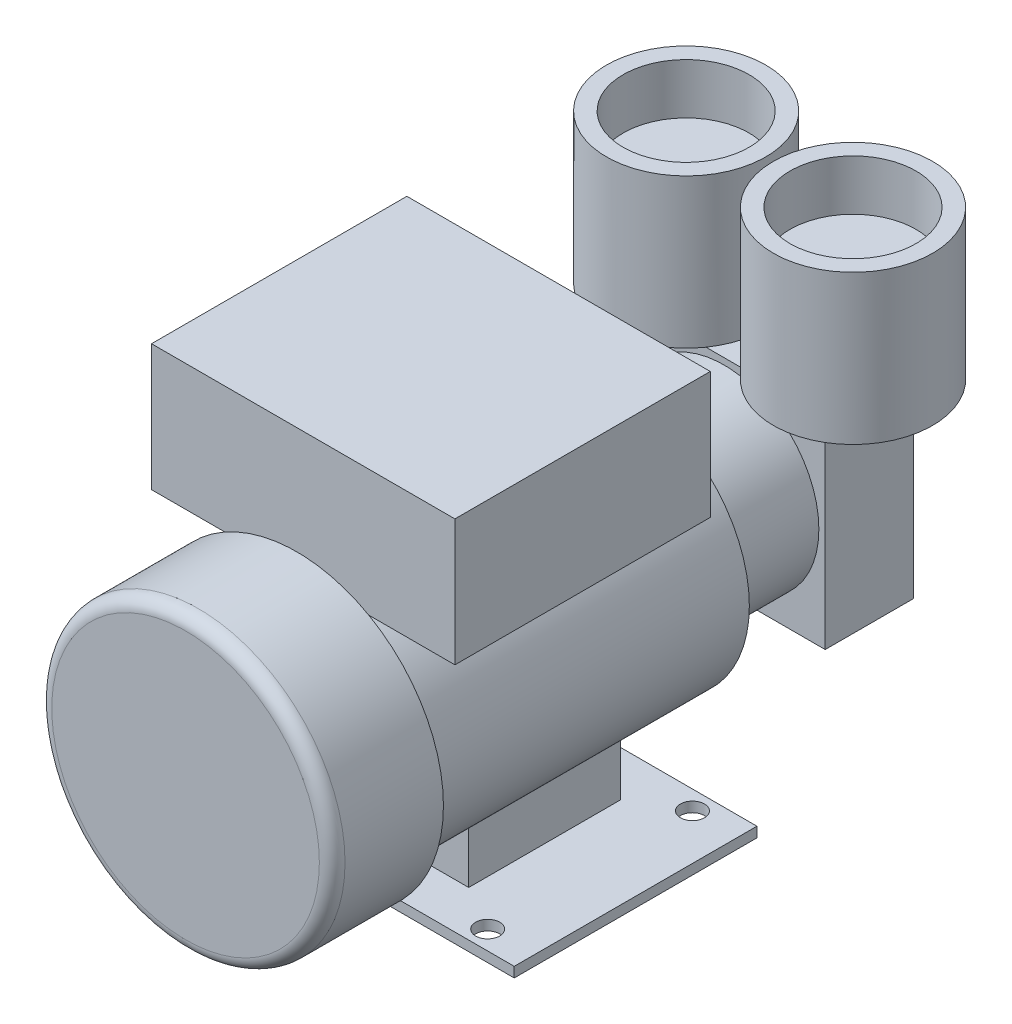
from build123d import *

# Parameters (mm, degrees)
SKETCH1_R              = 50
BOSS_EXTRUDE1_DEPTH    = 129
SKETCH2_W              = 132
SKETCH2_H              = 96
SKETCH2_R              = 4.75
BASE_PLATE_DEPTH       = 4
SKETCH3_R              = 37.5
MOTOR_PUMP_PLATE_DEPTH = 40
SKETCH18_W             = 101
SKETCH18_H             = 120
ELECTRICAL_BOX_DEPTH   = 50
SKETCH19_R             = 58
FAN_SHROUD_DEPTH       = 44
FILLET1_R              = 5.08
SKETCH20_W             = 80
SKETCH20_H             = 80
PUMP_HEAD_DEPTH        = 35
SKETCH21_W             = 60
SKETCH21_H             = 60
BOSS_EXTRUDE14_DEPTH   = 25
SKETCH23_R             = 31.5
BOSS_EXTRUDE15_DEPTH   = 59
SKETCH24_R             = 24.914163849
CUT_EXTRUDE1_DEPTH     = 20


with BuildPart() as part:
    # Sketch1 → Boss-Extrude1 (new body)
    with BuildSketch(Plane.XY):
        Circle(SKETCH1_R)
    extrude(amount=-BOSS_EXTRUDE1_DEPTH)

    # Sketch3 → Motor-pump-plate (add)
    with BuildSketch(Plane(origin=(0, 0, -129), x_dir=(-1, 0, 0), z_dir=(0, 0, -1))):
        with Locations(Location((0, 0, 0), (0, 0, 180))):
            Circle(SKETCH3_R)
    extrude(amount=MOTOR_PUMP_PLATE_DEPTH)

    # Sketch18 → Electrical_box (add)
    with BuildSketch(Plane(origin=(0, 48.000000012, 0), x_dir=(0, 0, -1), z_dir=(0, 1, 0))):
        with Locations((53.04, 0)):
            Rectangle(SKETCH18_W, SKETCH18_H)
    extrude(amount=ELECTRICAL_BOX_DEPTH)

    # Sketch19 → Fan_shroud (add)
    with BuildSketch(Plane.XY):
        Circle(SKETCH19_R)
    extrude(amount=FAN_SHROUD_DEPTH)

    # Fillet1
    fillet1_edges = [part.edges().sort_by_distance(p)[0] for p in [
        (-58, 0, 44),
    ]]
    fillet(fillet1_edges, radius=FILLET1_R)

    # Sketch20 → Pump_head (add)
    with BuildSketch(Plane(origin=(0, 0, -169), x_dir=(-1, 0, 0), z_dir=(0, 0, -1))):
        Rectangle(SKETCH20_W, SKETCH20_H)
    extrude(amount=PUMP_HEAD_DEPTH)



with BuildPart() as body_2:
    # Sketch2 → Base_plate (new body)
    with BuildSketch(Plane(origin=(0, -65, 0), x_dir=(-1, 0, 0), z_dir=(0, 1, 0))):
        with Locations((0, -68)):
            Rectangle(SKETCH2_W, SKETCH2_H)
        with Locations(Location((-48, -108.5, 0), (0, 0, 90))):
            Circle(SKETCH2_R, mode=Mode.SUBTRACT)
        with Locations(Location((48, -108.5, 0), (0, 0, 90))):
            Circle(SKETCH2_R, mode=Mode.SUBTRACT)
        with Locations(Location((-48, -27.5, 0), (0, 0, 90))):
            Circle(SKETCH2_R, mode=Mode.SUBTRACT)
        with Locations(Location((48, -27.5, 0), (0, 0, 90))):
            Circle(SKETCH2_R, mode=Mode.SUBTRACT)
    extrude(amount=BASE_PLATE_DEPTH)


with BuildPart() as part_1:
    add(part.part)

    add(body_2.part)  # Boss-Extrude14 merges body 2
    # Sketch21 → Boss-Extrude14 (add)
    with BuildSketch(Plane(origin=(0, -61, 0), x_dir=(1, 0, 0), z_dir=(0, 1, 0))):
        with Locations((0, 68)):
            Rectangle(SKETCH21_W, SKETCH21_H)
    extrude(amount=BOSS_EXTRUDE14_DEPTH)

    # Sketch23 → Boss-Extrude15 (add)
    with BuildSketch(Plane(origin=(0, 40, 0), x_dir=(1, 0, 0), z_dir=(0, 1, 0))):
        with Locations(Location((33, 187, 0), (0, 0, 147.337969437))):
            Circle(SKETCH23_R)
        with Locations(Location((-33, 187, 0), (0, 0, 90))):
            Circle(SKETCH23_R)
    extrude(amount=BOSS_EXTRUDE15_DEPTH)

    # Sketch24 → Cut-Extrude1 (cut)
    with BuildSketch(Plane(origin=(0, 99, 0), x_dir=(1, 0, 0), z_dir=(0, 1, 0))):
        with Locations(Location((33, 187, 0), (0, 0, 270))):
            Circle(SKETCH24_R)
        with Locations(Location((-33, 187, 0), (0, 0, 270))):
            Circle(SKETCH24_R)
    extrude(amount=-CUT_EXTRUDE1_DEPTH, mode=Mode.SUBTRACT)


solid = part_1.part
